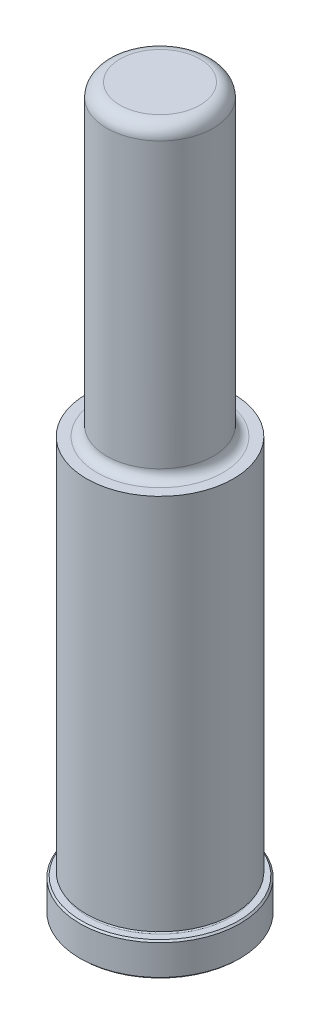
ISO-10303-21;
HEADER;
FILE_DESCRIPTION(('STEP AP214'),'2;1');
FILE_NAME('part.step','',(''),(''),'','','');
FILE_SCHEMA(('AUTOMOTIVE_DESIGN { 1 0 10303 214 1 1 1 1 }'));
ENDSEC;
DATA;
#1=APPLICATION_CONTEXT('core data for automotive mechanical design processes');
#2=APPLICATION_PROTOCOL_DEFINITION('international standard','automotive_design',2000,#1);
#3=PRODUCT_CONTEXT('',#1,'mechanical');
#4=PRODUCT('Part','Part','',(#3));
#5=PRODUCT_RELATED_PRODUCT_CATEGORY('part','',(#4));
#6=PRODUCT_DEFINITION_FORMATION('','',#4);
#7=PRODUCT_DEFINITION_CONTEXT('part definition',#1,'design');
#8=PRODUCT_DEFINITION('design','',#6,#7);
#9=PRODUCT_DEFINITION_SHAPE('','',#8);
#10=(LENGTH_UNIT() NAMED_UNIT(*) SI_UNIT(.MILLI.,.METRE.));
#11=(NAMED_UNIT(*) PLANE_ANGLE_UNIT() SI_UNIT($,.RADIAN.));
#12=(NAMED_UNIT(*) SI_UNIT($,.STERADIAN.) SOLID_ANGLE_UNIT());
#13=UNCERTAINTY_MEASURE_WITH_UNIT(LENGTH_MEASURE(1.E-05),#10,'distance_accuracy_value','');
#14=(GEOMETRIC_REPRESENTATION_CONTEXT(3) GLOBAL_UNCERTAINTY_ASSIGNED_CONTEXT((#13)) GLOBAL_UNIT_ASSIGNED_CONTEXT((#10,
#11,#12)) REPRESENTATION_CONTEXT('',''));
#15=CARTESIAN_POINT('',(0.,0.,0.));
#16=DIRECTION('',(0.,0.,1.));
#17=DIRECTION('',(1.,0.,0.));
#18=AXIS2_PLACEMENT_3D('',#15,#16,#17);
#19=CARTESIAN_POINT('',(0.,0.,0.));
#20=DIRECTION('',(0.,1.,0.));
#21=DIRECTION('',(0.,0.,1.));
#22=AXIS2_PLACEMENT_3D('',#19,#20,#21);
#23=PLANE('',#22);
#24=CARTESIAN_POINT('',(0.,0.,0.));
#25=DIRECTION('',(0.,1.,0.));
#26=DIRECTION('',(0.,0.,1.));
#27=AXIS2_PLACEMENT_3D('',#24,#25,#26);
#28=CIRCLE('',#27,18.6690000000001);
#29=CARTESIAN_POINT('',(0.,0.,18.6690000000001));
#30=VERTEX_POINT('',#29);
#31=EDGE_CURVE('E46',#30,#30,#28,.F.);
#32=ORIENTED_EDGE('',*,*,#31,.T.);
#33=EDGE_LOOP('',(#32));
#34=FACE_BOUND('',#33,.T.);
#35=ADVANCED_FACE('F31',(#34),#23,.F.);
#36=CARTESIAN_POINT('',(0.,0.,0.));
#37=DIRECTION('',(0.,1.,0.));
#38=DIRECTION('',(0.,0.,1.));
#39=AXIS2_PLACEMENT_3D('',#36,#37,#38);
#40=CYLINDRICAL_SURFACE('',#39,19.05);
#41=CARTESIAN_POINT('',(0.,0.38099999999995,0.));
#42=DIRECTION('',(0.,1.,0.));
#43=DIRECTION('',(0.,0.,1.));
#44=AXIS2_PLACEMENT_3D('',#41,#42,#43);
#45=CIRCLE('',#44,19.05);
#46=CARTESIAN_POINT('',(0.,0.380999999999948,19.05));
#47=VERTEX_POINT('',#46);
#48=EDGE_CURVE('E51',#47,#47,#45,.T.);
#49=ORIENTED_EDGE('',*,*,#48,.T.);
#50=EDGE_LOOP('',(#49));
#51=FACE_BOUND('',#50,.T.);
#52=CARTESIAN_POINT('',(0.,7.54379999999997,0.));
#53=DIRECTION('',(0.,-1.,0.));
#54=DIRECTION('',(0.,0.,-1.));
#55=AXIS2_PLACEMENT_3D('',#52,#53,#54);
#56=CIRCLE('',#55,19.05);
#57=CARTESIAN_POINT('',(0.,7.54379999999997,-19.05));
#58=VERTEX_POINT('',#57);
#59=EDGE_CURVE('E54',#58,#58,#56,.T.);
#60=ORIENTED_EDGE('',*,*,#59,.T.);
#61=EDGE_LOOP('',(#60));
#62=FACE_BOUND('',#61,.T.);
#63=ADVANCED_FACE('F110',(#51,#62),#40,.T.);
#64=CARTESIAN_POINT('',(0.,7.9248,-19.05));
#65=DIRECTION('',(0.,-1.,0.));
#66=DIRECTION('',(0.,0.,-1.));
#67=AXIS2_PLACEMENT_3D('',#64,#65,#66);
#68=PLANE('',#67);
#69=CARTESIAN_POINT('',(0.,7.9248,0.));
#70=DIRECTION('',(0.,-1.,0.));
#71=DIRECTION('',(0.,0.,-1.));
#72=AXIS2_PLACEMENT_3D('',#69,#70,#71);
#73=CIRCLE('',#72,18.669);
#74=CARTESIAN_POINT('',(0.,7.9248,-18.669));
#75=VERTEX_POINT('',#74);
#76=EDGE_CURVE('E42',#75,#75,#73,.F.);
#77=ORIENTED_EDGE('',*,*,#76,.T.);
#78=EDGE_LOOP('',(#77));
#79=FACE_BOUND('',#78,.T.);
#80=CARTESIAN_POINT('',(0.,7.9248,0.));
#81=DIRECTION('',(0.,1.,0.));
#82=DIRECTION('',(0.,0.,1.));
#83=AXIS2_PLACEMENT_3D('',#80,#81,#82);
#84=CIRCLE('',#83,17.0688);
#85=CARTESIAN_POINT('',(0.,7.92479999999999,17.0688));
#86=VERTEX_POINT('',#85);
#87=EDGE_CURVE('E57',#86,#86,#84,.T.);
#88=ORIENTED_EDGE('',*,*,#87,.F.);
#89=EDGE_LOOP('',(#88));
#90=FACE_BOUND('',#89,.T.);
#91=ADVANCED_FACE('F105',(#79,#90),#68,.F.);
#92=CARTESIAN_POINT('',(0.,8.3058,0.));
#93=DIRECTION('',(0.,1.,0.));
#94=DIRECTION('',(0.,0.,1.));
#95=AXIS2_PLACEMENT_3D('',#92,#93,#94);
#96=TOROIDAL_SURFACE('',#95,17.0688,0.381000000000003);
#97=CARTESIAN_POINT('',(0.,8.6868,0.));
#98=DIRECTION('',(0.,1.,0.));
#99=DIRECTION('',(0.,0.,1.));
#100=AXIS2_PLACEMENT_3D('',#97,#98,#99);
#101=CIRCLE('',#100,17.0688);
#102=CARTESIAN_POINT('',(0.,8.6868,17.0688));
#103=VERTEX_POINT('',#102);
#104=EDGE_CURVE('E60',#103,#103,#101,.T.);
#105=ORIENTED_EDGE('',*,*,#104,.F.);
#106=EDGE_LOOP('',(#105));
#107=FACE_BOUND('',#106,.T.);
#108=ORIENTED_EDGE('',*,*,#87,.T.);
#109=EDGE_LOOP('',(#108));
#110=FACE_BOUND('',#109,.T.);
#111=ADVANCED_FACE('F99',(#107,#110),#96,.F.);
#112=CARTESIAN_POINT('',(0.,8.6868,-17.0688));
#113=DIRECTION('',(0.,1.,0.));
#114=DIRECTION('',(0.,0.,1.));
#115=AXIS2_PLACEMENT_3D('',#112,#113,#114);
#116=PLANE('',#115);
#117=CARTESIAN_POINT('',(0.,8.6868,0.));
#118=DIRECTION('',(0.,1.,0.));
#119=DIRECTION('',(0.,0.,1.));
#120=AXIS2_PLACEMENT_3D('',#117,#118,#119);
#121=CIRCLE('',#120,17.4752);
#122=CARTESIAN_POINT('',(0.,8.6868,17.4752));
#123=VERTEX_POINT('',#122);
#124=EDGE_CURVE('E63',#123,#123,#121,.T.);
#125=ORIENTED_EDGE('',*,*,#124,.F.);
#126=EDGE_LOOP('',(#125));
#127=FACE_BOUND('',#126,.T.);
#128=ORIENTED_EDGE('',*,*,#104,.T.);
#129=EDGE_LOOP('',(#128));
#130=FACE_BOUND('',#129,.T.);
#131=ADVANCED_FACE('F93',(#127,#130),#116,.F.);
#132=CARTESIAN_POINT('',(0.,0.,0.));
#133=DIRECTION('',(0.,1.,0.));
#134=DIRECTION('',(0.,0.,1.));
#135=AXIS2_PLACEMENT_3D('',#132,#133,#134);
#136=CYLINDRICAL_SURFACE('',#135,17.4752);
#137=CARTESIAN_POINT('',(0.,98.425,0.));
#138=DIRECTION('',(0.,1.,0.));
#139=DIRECTION('',(0.,0.,1.));
#140=AXIS2_PLACEMENT_3D('',#137,#138,#139);
#141=CIRCLE('',#140,17.4752);
#142=CARTESIAN_POINT('',(0.,98.425,17.4752));
#143=VERTEX_POINT('',#142);
#144=EDGE_CURVE('E66',#143,#143,#141,.T.);
#145=ORIENTED_EDGE('',*,*,#144,.F.);
#146=EDGE_LOOP('',(#145));
#147=FACE_BOUND('',#146,.T.);
#148=ORIENTED_EDGE('',*,*,#124,.T.);
#149=EDGE_LOOP('',(#148));
#150=FACE_BOUND('',#149,.T.);
#151=ADVANCED_FACE('F87',(#147,#150),#136,.T.);
#152=CARTESIAN_POINT('',(0.,98.425,-17.4752));
#153=DIRECTION('',(0.,-1.,0.));
#154=DIRECTION('',(0.,0.,-1.));
#155=AXIS2_PLACEMENT_3D('',#152,#153,#154);
#156=PLANE('',#155);
#157=CARTESIAN_POINT('',(0.,98.425,0.));
#158=DIRECTION('',(0.,1.,0.));
#159=DIRECTION('',(0.,0.,1.));
#160=AXIS2_PLACEMENT_3D('',#157,#158,#159);
#161=CIRCLE('',#160,14.9733);
#162=CARTESIAN_POINT('',(0.,98.425,14.9733));
#163=VERTEX_POINT('',#162);
#164=EDGE_CURVE('E69',#163,#163,#161,.T.);
#165=ORIENTED_EDGE('',*,*,#164,.F.);
#166=EDGE_LOOP('',(#165));
#167=FACE_BOUND('',#166,.T.);
#168=ORIENTED_EDGE('',*,*,#144,.T.);
#169=EDGE_LOOP('',(#168));
#170=FACE_BOUND('',#169,.T.);
#171=ADVANCED_FACE('F81',(#167,#170),#156,.F.);
#172=CARTESIAN_POINT('',(0.,100.711,0.));
#173=DIRECTION('',(0.,1.,0.));
#174=DIRECTION('',(0.,0.,1.));
#175=AXIS2_PLACEMENT_3D('',#172,#173,#174);
#176=TOROIDAL_SURFACE('',#175,14.9733,2.286);
#177=CARTESIAN_POINT('',(0.,100.711,0.));
#178=DIRECTION('',(0.,1.,0.));
#179=DIRECTION('',(0.,0.,1.));
#180=AXIS2_PLACEMENT_3D('',#177,#178,#179);
#181=CIRCLE('',#180,12.6873);
#182=CARTESIAN_POINT('',(0.,100.711,12.6873));
#183=VERTEX_POINT('',#182);
#184=EDGE_CURVE('E72',#183,#183,#181,.T.);
#185=ORIENTED_EDGE('',*,*,#184,.F.);
#186=EDGE_LOOP('',(#185));
#187=FACE_BOUND('',#186,.T.);
#188=ORIENTED_EDGE('',*,*,#164,.T.);
#189=EDGE_LOOP('',(#188));
#190=FACE_BOUND('',#189,.T.);
#191=ADVANCED_FACE('F78',(#187,#190),#176,.F.);
#192=CARTESIAN_POINT('',(0.,0.,0.));
#193=DIRECTION('',(0.,1.,0.));
#194=DIRECTION('',(0.,0.,1.));
#195=AXIS2_PLACEMENT_3D('',#192,#193,#194);
#196=CYLINDRICAL_SURFACE('',#195,12.6873);
#197=CARTESIAN_POINT('',(0.,168.275,0.));
#198=DIRECTION('',(0.,-1.,0.));
#199=DIRECTION('',(0.,0.,-1.));
#200=AXIS2_PLACEMENT_3D('',#197,#198,#199);
#201=CIRCLE('',#200,12.6873);
#202=CARTESIAN_POINT('',(0.,168.275,-12.6873));
#203=VERTEX_POINT('',#202);
#204=EDGE_CURVE('E10',#203,#203,#201,.T.);
#205=ORIENTED_EDGE('',*,*,#204,.T.);
#206=EDGE_LOOP('',(#205));
#207=FACE_BOUND('',#206,.T.);
#208=ORIENTED_EDGE('',*,*,#184,.T.);
#209=EDGE_LOOP('',(#208));
#210=FACE_BOUND('',#209,.T.);
#211=ADVANCED_FACE('F76',(#207,#210),#196,.T.);
#212=CARTESIAN_POINT('',(0.,171.45,-12.6873));
#213=DIRECTION('',(0.,-1.,0.));
#214=DIRECTION('',(0.,0.,-1.));
#215=AXIS2_PLACEMENT_3D('',#212,#213,#214);
#216=PLANE('',#215);
#217=CARTESIAN_POINT('',(0.,171.45,0.));
#218=DIRECTION('',(0.,-1.,0.));
#219=DIRECTION('',(0.,0.,-1.));
#220=AXIS2_PLACEMENT_3D('',#217,#218,#219);
#221=CIRCLE('',#220,9.51230000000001);
#222=CARTESIAN_POINT('',(0.,171.45,-9.51229999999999));
#223=VERTEX_POINT('',#222);
#224=EDGE_CURVE('E38',#223,#223,#221,.F.);
#225=ORIENTED_EDGE('',*,*,#224,.T.);
#226=EDGE_LOOP('',(#225));
#227=FACE_BOUND('',#226,.T.);
#228=ADVANCED_FACE('F127',(#227),#216,.F.);
#229=CARTESIAN_POINT('',(0.,0.38099999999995,0.));
#230=DIRECTION('',(0.,1.,0.));
#231=DIRECTION('',(0.,0.,1.));
#232=AXIS2_PLACEMENT_3D('',#229,#230,#231);
#233=CONICAL_SURFACE('',#232,19.05,0.785398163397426);
#234=ORIENTED_EDGE('',*,*,#31,.F.);
#235=EDGE_LOOP('',(#234));
#236=FACE_BOUND('',#235,.T.);
#237=ORIENTED_EDGE('',*,*,#48,.F.);
#238=EDGE_LOOP('',(#237));
#239=FACE_BOUND('',#238,.T.);
#240=ADVANCED_FACE('F124',(#236,#239),#233,.T.);
#241=CARTESIAN_POINT('',(0.,7.9248,0.));
#242=DIRECTION('',(0.,-1.,0.));
#243=DIRECTION('',(0.,0.,-1.));
#244=AXIS2_PLACEMENT_3D('',#241,#242,#243);
#245=CONICAL_SURFACE('',#244,18.669,0.785398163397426);
#246=ORIENTED_EDGE('',*,*,#59,.F.);
#247=EDGE_LOOP('',(#246));
#248=FACE_BOUND('',#247,.T.);
#249=ORIENTED_EDGE('',*,*,#76,.F.);
#250=EDGE_LOOP('',(#249));
#251=FACE_BOUND('',#250,.T.);
#252=ADVANCED_FACE('F126',(#248,#251),#245,.T.);
#253=CARTESIAN_POINT('',(0.,168.275,0.));
#254=DIRECTION('',(0.,-1.,0.));
#255=DIRECTION('',(0.,0.,-1.));
#256=AXIS2_PLACEMENT_3D('',#253,#254,#255);
#257=TOROIDAL_SURFACE('',#256,9.51230000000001,3.175);
#258=ORIENTED_EDGE('',*,*,#204,.F.);
#259=EDGE_LOOP('',(#258));
#260=FACE_BOUND('',#259,.T.);
#261=ORIENTED_EDGE('',*,*,#224,.F.);
#262=EDGE_LOOP('',(#261));
#263=FACE_BOUND('',#262,.T.);
#264=ADVANCED_FACE('F33',(#260,#263),#257,.T.);
#265=CLOSED_SHELL('',(#35,#63,#91,#111,#131,#151,#171,#191,#211,#228,#240,#252,#264));
#266=MANIFOLD_SOLID_BREP('B2',#265);
#267=ADVANCED_BREP_SHAPE_REPRESENTATION('',(#18,#266),#14);
#268=SHAPE_DEFINITION_REPRESENTATION(#9,#267);
ENDSEC;
END-ISO-10303-21;
